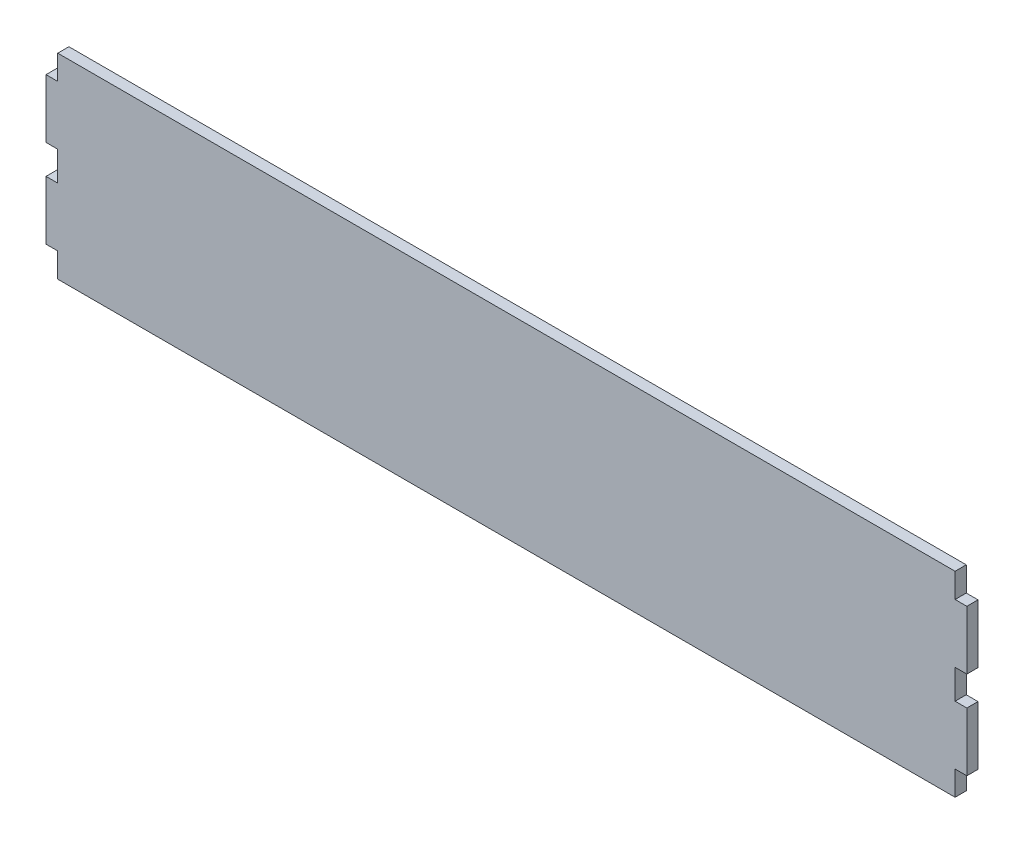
ISO-10303-21;
HEADER;
FILE_DESCRIPTION(('STEP AP214'),'2;1');
FILE_NAME('part.step','',(''),(''),'','','');
FILE_SCHEMA(('AUTOMOTIVE_DESIGN { 1 0 10303 214 1 1 1 1 }'));
ENDSEC;
DATA;
#1=APPLICATION_CONTEXT('core data for automotive mechanical design processes');
#2=APPLICATION_PROTOCOL_DEFINITION('international standard','automotive_design',2000,#1);
#3=PRODUCT_CONTEXT('',#1,'mechanical');
#4=PRODUCT('Part','Part','',(#3));
#5=PRODUCT_RELATED_PRODUCT_CATEGORY('part','',(#4));
#6=PRODUCT_DEFINITION_FORMATION('','',#4);
#7=PRODUCT_DEFINITION_CONTEXT('part definition',#1,'design');
#8=PRODUCT_DEFINITION('design','',#6,#7);
#9=PRODUCT_DEFINITION_SHAPE('','',#8);
#10=(LENGTH_UNIT() NAMED_UNIT(*) SI_UNIT(.MILLI.,.METRE.));
#11=(NAMED_UNIT(*) PLANE_ANGLE_UNIT() SI_UNIT($,.RADIAN.));
#12=(NAMED_UNIT(*) SI_UNIT($,.STERADIAN.) SOLID_ANGLE_UNIT());
#13=UNCERTAINTY_MEASURE_WITH_UNIT(LENGTH_MEASURE(1.E-05),#10,'distance_accuracy_value','');
#14=(GEOMETRIC_REPRESENTATION_CONTEXT(3) GLOBAL_UNCERTAINTY_ASSIGNED_CONTEXT((#13)) GLOBAL_UNIT_ASSIGNED_CONTEXT((#10,
#11,#12)) REPRESENTATION_CONTEXT('',''));
#15=CARTESIAN_POINT('',(0.,0.,0.));
#16=DIRECTION('',(0.,0.,1.));
#17=DIRECTION('',(1.,0.,0.));
#18=AXIS2_PLACEMENT_3D('',#15,#16,#17);
#19=CARTESIAN_POINT('',(229.2,-50.,5.7));
#20=DIRECTION('',(-1.,0.,0.));
#21=DIRECTION('',(0.,0.,1.));
#22=AXIS2_PLACEMENT_3D('',#19,#20,#21);
#23=PLANE('',#22);
#24=DIRECTION('',(0.,0.,1.));
#25=VECTOR('',#24,1.);
#26=CARTESIAN_POINT('',(229.2,-7.5,0.));
#27=LINE('',#26,#25);
#28=CARTESIAN_POINT('',(229.2,-7.5,0.));
#29=VERTEX_POINT('',#28);
#30=CARTESIAN_POINT('',(229.2,-7.5,5.7));
#31=VERTEX_POINT('',#30);
#32=EDGE_CURVE('E332',#29,#31,#27,.T.);
#33=ORIENTED_EDGE('',*,*,#32,.F.);
#34=DIRECTION('',(0.,1.,0.));
#35=VECTOR('',#34,1.);
#36=CARTESIAN_POINT('',(229.2,-50.,0.));
#37=LINE('',#36,#35);
#38=CARTESIAN_POINT('',(229.2,7.5,0.));
#39=VERTEX_POINT('',#38);
#40=EDGE_CURVE('E193',#29,#39,#37,.T.);
#41=ORIENTED_EDGE('',*,*,#40,.T.);
#42=DIRECTION('',(0.,0.,-1.));
#43=VECTOR('',#42,1.);
#44=CARTESIAN_POINT('',(229.2,7.5,0.));
#45=LINE('',#44,#43);
#46=CARTESIAN_POINT('',(229.2,7.5,5.7));
#47=VERTEX_POINT('',#46);
#48=EDGE_CURVE('E197',#47,#39,#45,.T.);
#49=ORIENTED_EDGE('',*,*,#48,.F.);
#50=DIRECTION('',(0.,1.,0.));
#51=VECTOR('',#50,1.);
#52=CARTESIAN_POINT('',(229.2,-50.,5.7));
#53=LINE('',#52,#51);
#54=EDGE_CURVE('E46',#31,#47,#53,.T.);
#55=ORIENTED_EDGE('',*,*,#54,.F.);
#56=EDGE_LOOP('',(#33,#41,#49,#55));
#57=FACE_BOUND('',#56,.T.);
#58=ADVANCED_FACE('F32',(#57),#23,.F.);
#59=DIRECTION('',(0.,0.,-1.));
#60=VECTOR('',#59,1.);
#61=CARTESIAN_POINT('',(229.2,-37.5,0.));
#62=LINE('',#61,#60);
#63=CARTESIAN_POINT('',(229.2,-37.5,5.7));
#64=VERTEX_POINT('',#63);
#65=CARTESIAN_POINT('',(229.2,-37.5,0.));
#66=VERTEX_POINT('',#65);
#67=EDGE_CURVE('E54',#64,#66,#62,.T.);
#68=ORIENTED_EDGE('',*,*,#67,.F.);
#69=CARTESIAN_POINT('',(229.2,-50.,5.7));
#70=VERTEX_POINT('',#69);
#71=EDGE_CURVE('E280',#70,#64,#53,.T.);
#72=ORIENTED_EDGE('',*,*,#71,.F.);
#73=DIRECTION('',(0.,0.,-1.));
#74=VECTOR('',#73,1.);
#75=CARTESIAN_POINT('',(229.2,-50.,5.7));
#76=LINE('',#75,#74);
#77=CARTESIAN_POINT('',(229.2,-50.,0.));
#78=VERTEX_POINT('',#77);
#79=EDGE_CURVE('E292',#70,#78,#76,.T.);
#80=ORIENTED_EDGE('',*,*,#79,.T.);
#81=EDGE_CURVE('E293',#78,#66,#37,.T.);
#82=ORIENTED_EDGE('',*,*,#81,.T.);
#83=EDGE_LOOP('',(#68,#72,#80,#82));
#84=FACE_BOUND('',#83,.T.);
#85=ADVANCED_FACE('F355',(#84),#23,.F.);
#86=DIRECTION('',(0.,0.,1.));
#87=VECTOR('',#86,1.);
#88=CARTESIAN_POINT('',(229.2,37.5,0.));
#89=LINE('',#88,#87);
#90=CARTESIAN_POINT('',(229.2,37.5,0.));
#91=VERTEX_POINT('',#90);
#92=CARTESIAN_POINT('',(229.2,37.5,5.70000000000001));
#93=VERTEX_POINT('',#92);
#94=EDGE_CURVE('E194',#91,#93,#89,.T.);
#95=ORIENTED_EDGE('',*,*,#94,.F.);
#96=CARTESIAN_POINT('',(229.2,50.,0.));
#97=VERTEX_POINT('',#96);
#98=EDGE_CURVE('E279',#91,#97,#37,.T.);
#99=ORIENTED_EDGE('',*,*,#98,.T.);
#100=DIRECTION('',(0.,0.,-1.));
#101=VECTOR('',#100,1.);
#102=CARTESIAN_POINT('',(229.2,50.,5.7));
#103=LINE('',#102,#101);
#104=CARTESIAN_POINT('',(229.2,50.,5.7));
#105=VERTEX_POINT('',#104);
#106=EDGE_CURVE('E11',#105,#97,#103,.T.);
#107=ORIENTED_EDGE('',*,*,#106,.F.);
#108=EDGE_CURVE('E283',#93,#105,#53,.T.);
#109=ORIENTED_EDGE('',*,*,#108,.F.);
#110=EDGE_LOOP('',(#95,#99,#107,#109));
#111=FACE_BOUND('',#110,.T.);
#112=ADVANCED_FACE('F330',(#111),#23,.F.);
#113=CARTESIAN_POINT('',(-229.2,-50.,5.7));
#114=DIRECTION('',(1.,0.,0.));
#115=DIRECTION('',(0.,0.,-1.));
#116=AXIS2_PLACEMENT_3D('',#113,#114,#115);
#117=PLANE('',#116);
#118=DIRECTION('',(0.,0.,1.));
#119=VECTOR('',#118,1.);
#120=CARTESIAN_POINT('',(-229.2,7.5,0.));
#121=LINE('',#120,#119);
#122=CARTESIAN_POINT('',(-229.2,7.5,0.));
#123=VERTEX_POINT('',#122);
#124=CARTESIAN_POINT('',(-229.2,7.5,5.7));
#125=VERTEX_POINT('',#124);
#126=EDGE_CURVE('E225',#123,#125,#121,.T.);
#127=ORIENTED_EDGE('',*,*,#126,.F.);
#128=DIRECTION('',(0.,-1.,0.));
#129=VECTOR('',#128,1.);
#130=CARTESIAN_POINT('',(-229.2,-50.,0.));
#131=LINE('',#130,#129);
#132=CARTESIAN_POINT('',(-229.2,-7.5,0.));
#133=VERTEX_POINT('',#132);
#134=EDGE_CURVE('E301',#123,#133,#131,.T.);
#135=ORIENTED_EDGE('',*,*,#134,.T.);
#136=DIRECTION('',(0.,0.,-1.));
#137=VECTOR('',#136,1.);
#138=CARTESIAN_POINT('',(-229.2,-7.5,0.));
#139=LINE('',#138,#137);
#140=CARTESIAN_POINT('',(-229.2,-7.5,5.7));
#141=VERTEX_POINT('',#140);
#142=EDGE_CURVE('E257',#141,#133,#139,.T.);
#143=ORIENTED_EDGE('',*,*,#142,.F.);
#144=DIRECTION('',(0.,-1.,0.));
#145=VECTOR('',#144,1.);
#146=CARTESIAN_POINT('',(-229.2,-50.,5.7));
#147=LINE('',#146,#145);
#148=EDGE_CURVE('E290',#125,#141,#147,.T.);
#149=ORIENTED_EDGE('',*,*,#148,.F.);
#150=EDGE_LOOP('',(#127,#135,#143,#149));
#151=FACE_BOUND('',#150,.T.);
#152=ADVANCED_FACE('F367',(#151),#117,.F.);
#153=DIRECTION('',(0.,0.,-1.));
#154=VECTOR('',#153,1.);
#155=CARTESIAN_POINT('',(-229.2,37.5,0.));
#156=LINE('',#155,#154);
#157=CARTESIAN_POINT('',(-229.2,37.5,5.7));
#158=VERTEX_POINT('',#157);
#159=CARTESIAN_POINT('',(-229.2,37.5,0.));
#160=VERTEX_POINT('',#159);
#161=EDGE_CURVE('E230',#158,#160,#156,.T.);
#162=ORIENTED_EDGE('',*,*,#161,.F.);
#163=CARTESIAN_POINT('',(-229.2,50.,5.7));
#164=VERTEX_POINT('',#163);
#165=EDGE_CURVE('E286',#164,#158,#147,.T.);
#166=ORIENTED_EDGE('',*,*,#165,.F.);
#167=DIRECTION('',(0.,0.,-1.));
#168=VECTOR('',#167,1.);
#169=CARTESIAN_POINT('',(-229.2,50.,5.7));
#170=LINE('',#169,#168);
#171=CARTESIAN_POINT('',(-229.2,50.,0.));
#172=VERTEX_POINT('',#171);
#173=EDGE_CURVE('E39',#164,#172,#170,.T.);
#174=ORIENTED_EDGE('',*,*,#173,.T.);
#175=EDGE_CURVE('E298',#172,#160,#131,.T.);
#176=ORIENTED_EDGE('',*,*,#175,.T.);
#177=EDGE_LOOP('',(#162,#166,#174,#176));
#178=FACE_BOUND('',#177,.T.);
#179=ADVANCED_FACE('F312',(#178),#117,.F.);
#180=DIRECTION('',(0.,0.,1.));
#181=VECTOR('',#180,1.);
#182=CARTESIAN_POINT('',(-229.2,-37.5,0.));
#183=LINE('',#182,#181);
#184=CARTESIAN_POINT('',(-229.2,-37.5,0.));
#185=VERTEX_POINT('',#184);
#186=CARTESIAN_POINT('',(-229.2,-37.5,5.7));
#187=VERTEX_POINT('',#186);
#188=EDGE_CURVE('E252',#185,#187,#183,.T.);
#189=ORIENTED_EDGE('',*,*,#188,.F.);
#190=CARTESIAN_POINT('',(-229.2,-50.,0.));
#191=VERTEX_POINT('',#190);
#192=EDGE_CURVE('E297',#185,#191,#131,.T.);
#193=ORIENTED_EDGE('',*,*,#192,.T.);
#194=DIRECTION('',(0.,0.,-1.));
#195=VECTOR('',#194,1.);
#196=CARTESIAN_POINT('',(-229.2,-50.,5.7));
#197=LINE('',#196,#195);
#198=CARTESIAN_POINT('',(-229.2,-50.,5.7));
#199=VERTEX_POINT('',#198);
#200=EDGE_CURVE('E305',#199,#191,#197,.T.);
#201=ORIENTED_EDGE('',*,*,#200,.F.);
#202=EDGE_CURVE('E285',#187,#199,#147,.T.);
#203=ORIENTED_EDGE('',*,*,#202,.F.);
#204=EDGE_LOOP('',(#189,#193,#201,#203));
#205=FACE_BOUND('',#204,.T.);
#206=ADVANCED_FACE('F362',(#205),#117,.F.);
#207=CARTESIAN_POINT('',(-229.2,50.,5.7));
#208=DIRECTION('',(0.,-1.,0.));
#209=DIRECTION('',(0.,0.,-1.));
#210=AXIS2_PLACEMENT_3D('',#207,#208,#209);
#211=PLANE('',#210);
#212=DIRECTION('',(-1.,0.,0.));
#213=VECTOR('',#212,1.);
#214=CARTESIAN_POINT('',(-229.2,50.,0.));
#215=LINE('',#214,#213);
#216=EDGE_CURVE('E295',#97,#172,#215,.T.);
#217=ORIENTED_EDGE('',*,*,#216,.T.);
#218=ORIENTED_EDGE('',*,*,#173,.F.);
#219=DIRECTION('',(-1.,0.,0.));
#220=VECTOR('',#219,1.);
#221=CARTESIAN_POINT('',(-229.2,50.,5.7));
#222=LINE('',#221,#220);
#223=EDGE_CURVE('E282',#105,#164,#222,.T.);
#224=ORIENTED_EDGE('',*,*,#223,.F.);
#225=ORIENTED_EDGE('',*,*,#106,.T.);
#226=EDGE_LOOP('',(#217,#218,#224,#225));
#227=FACE_BOUND('',#226,.T.);
#228=ADVANCED_FACE('F328',(#227),#211,.F.);
#229=CARTESIAN_POINT('',(-229.2,-50.,5.7));
#230=DIRECTION('',(0.,1.,0.));
#231=DIRECTION('',(0.,0.,1.));
#232=AXIS2_PLACEMENT_3D('',#229,#230,#231);
#233=PLANE('',#232);
#234=DIRECTION('',(1.,0.,0.));
#235=VECTOR('',#234,1.);
#236=CARTESIAN_POINT('',(-229.2,-50.,0.));
#237=LINE('',#236,#235);
#238=EDGE_CURVE('E300',#191,#78,#237,.T.);
#239=ORIENTED_EDGE('',*,*,#238,.T.);
#240=ORIENTED_EDGE('',*,*,#79,.F.);
#241=DIRECTION('',(1.,0.,0.));
#242=VECTOR('',#241,1.);
#243=CARTESIAN_POINT('',(-229.2,-50.,5.7));
#244=LINE('',#243,#242);
#245=EDGE_CURVE('E289',#199,#70,#244,.T.);
#246=ORIENTED_EDGE('',*,*,#245,.F.);
#247=ORIENTED_EDGE('',*,*,#200,.T.);
#248=EDGE_LOOP('',(#239,#240,#246,#247));
#249=FACE_BOUND('',#248,.T.);
#250=ADVANCED_FACE('F359',(#249),#233,.F.);
#251=CARTESIAN_POINT('',(0.,0.,5.7));
#252=DIRECTION('',(0.,0.,-1.));
#253=DIRECTION('',(-1.,0.,0.));
#254=AXIS2_PLACEMENT_3D('',#251,#252,#253);
#255=PLANE('',#254);
#256=ORIENTED_EDGE('',*,*,#71,.T.);
#257=DIRECTION('',(-1.,0.,0.));
#258=VECTOR('',#257,1.);
#259=CARTESIAN_POINT('',(235.2,-37.5,5.7));
#260=LINE('',#259,#258);
#261=CARTESIAN_POINT('',(235.2,-37.5,5.7));
#262=VERTEX_POINT('',#261);
#263=EDGE_CURVE('E199',#262,#64,#260,.T.);
#264=ORIENTED_EDGE('',*,*,#263,.F.);
#265=DIRECTION('',(0.,-1.,0.));
#266=VECTOR('',#265,1.);
#267=CARTESIAN_POINT('',(235.2,-7.5,5.70000000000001));
#268=LINE('',#267,#266);
#269=CARTESIAN_POINT('',(235.2,-7.5,5.70000000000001));
#270=VERTEX_POINT('',#269);
#271=EDGE_CURVE('E179',#270,#262,#268,.T.);
#272=ORIENTED_EDGE('',*,*,#271,.F.);
#273=DIRECTION('',(-1.,0.,0.));
#274=VECTOR('',#273,1.);
#275=CARTESIAN_POINT('',(235.2,-7.5,5.70000000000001));
#276=LINE('',#275,#274);
#277=EDGE_CURVE('E176',#270,#31,#276,.T.);
#278=ORIENTED_EDGE('',*,*,#277,.T.);
#279=ORIENTED_EDGE('',*,*,#54,.T.);
#280=DIRECTION('',(-1.,0.,0.));
#281=VECTOR('',#280,1.);
#282=CARTESIAN_POINT('',(235.2,7.5,5.70000000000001));
#283=LINE('',#282,#281);
#284=CARTESIAN_POINT('',(235.2,7.5,5.70000000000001));
#285=VERTEX_POINT('',#284);
#286=EDGE_CURVE('E216',#285,#47,#283,.T.);
#287=ORIENTED_EDGE('',*,*,#286,.F.);
#288=DIRECTION('',(0.,-1.,0.));
#289=VECTOR('',#288,1.);
#290=CARTESIAN_POINT('',(235.2,37.5,5.70000000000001));
#291=LINE('',#290,#289);
#292=CARTESIAN_POINT('',(235.2,37.5,5.70000000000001));
#293=VERTEX_POINT('',#292);
#294=EDGE_CURVE('E208',#293,#285,#291,.T.);
#295=ORIENTED_EDGE('',*,*,#294,.F.);
#296=DIRECTION('',(-1.,0.,0.));
#297=VECTOR('',#296,1.);
#298=CARTESIAN_POINT('',(235.2,37.5,5.70000000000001));
#299=LINE('',#298,#297);
#300=EDGE_CURVE('E219',#293,#93,#299,.T.);
#301=ORIENTED_EDGE('',*,*,#300,.T.);
#302=ORIENTED_EDGE('',*,*,#108,.T.);
#303=ORIENTED_EDGE('',*,*,#223,.T.);
#304=ORIENTED_EDGE('',*,*,#165,.T.);
#305=DIRECTION('',(1.,0.,0.));
#306=VECTOR('',#305,1.);
#307=CARTESIAN_POINT('',(-235.2,37.5,5.7));
#308=LINE('',#307,#306);
#309=CARTESIAN_POINT('',(-235.2,37.5,5.7));
#310=VERTEX_POINT('',#309);
#311=EDGE_CURVE('E243',#310,#158,#308,.T.);
#312=ORIENTED_EDGE('',*,*,#311,.F.);
#313=DIRECTION('',(0.,1.,0.));
#314=VECTOR('',#313,1.);
#315=CARTESIAN_POINT('',(-235.2,7.5,5.7));
#316=LINE('',#315,#314);
#317=CARTESIAN_POINT('',(-235.2,7.5,5.7));
#318=VERTEX_POINT('',#317);
#319=EDGE_CURVE('E232',#318,#310,#316,.T.);
#320=ORIENTED_EDGE('',*,*,#319,.F.);
#321=DIRECTION('',(1.,0.,0.));
#322=VECTOR('',#321,1.);
#323=CARTESIAN_POINT('',(-235.2,7.5,5.7));
#324=LINE('',#323,#322);
#325=EDGE_CURVE('E246',#318,#125,#324,.T.);
#326=ORIENTED_EDGE('',*,*,#325,.T.);
#327=ORIENTED_EDGE('',*,*,#148,.T.);
#328=DIRECTION('',(1.,0.,0.));
#329=VECTOR('',#328,1.);
#330=CARTESIAN_POINT('',(-235.2,-7.5,5.7));
#331=LINE('',#330,#329);
#332=CARTESIAN_POINT('',(-235.2,-7.5,5.7));
#333=VERTEX_POINT('',#332);
#334=EDGE_CURVE('E270',#333,#141,#331,.T.);
#335=ORIENTED_EDGE('',*,*,#334,.F.);
#336=DIRECTION('',(0.,1.,0.));
#337=VECTOR('',#336,1.);
#338=CARTESIAN_POINT('',(-235.2,-37.5,5.7));
#339=LINE('',#338,#337);
#340=CARTESIAN_POINT('',(-235.2,-37.5,5.7));
#341=VERTEX_POINT('',#340);
#342=EDGE_CURVE('E259',#341,#333,#339,.T.);
#343=ORIENTED_EDGE('',*,*,#342,.F.);
#344=DIRECTION('',(1.,0.,0.));
#345=VECTOR('',#344,1.);
#346=CARTESIAN_POINT('',(-235.2,-37.5,5.7));
#347=LINE('',#346,#345);
#348=EDGE_CURVE('E273',#341,#187,#347,.T.);
#349=ORIENTED_EDGE('',*,*,#348,.T.);
#350=ORIENTED_EDGE('',*,*,#202,.T.);
#351=ORIENTED_EDGE('',*,*,#245,.T.);
#352=EDGE_LOOP('',(#256,#264,#272,#278,#279,#287,#295,#301,#302,#303,#304,#312,#320,#326,#327,
#335,#343,#349,#350,#351));
#353=FACE_BOUND('',#352,.T.);
#354=ADVANCED_FACE('F325',(#353),#255,.F.);
#355=CARTESIAN_POINT('',(0.,0.,0.));
#356=DIRECTION('',(0.,0.,-1.));
#357=DIRECTION('',(-1.,0.,0.));
#358=AXIS2_PLACEMENT_3D('',#355,#356,#357);
#359=PLANE('',#358);
#360=ORIENTED_EDGE('',*,*,#81,.F.);
#361=ORIENTED_EDGE('',*,*,#238,.F.);
#362=ORIENTED_EDGE('',*,*,#192,.F.);
#363=DIRECTION('',(1.,0.,0.));
#364=VECTOR('',#363,1.);
#365=CARTESIAN_POINT('',(-235.2,-37.5,0.));
#366=LINE('',#365,#364);
#367=CARTESIAN_POINT('',(-235.2,-37.5,0.));
#368=VERTEX_POINT('',#367);
#369=EDGE_CURVE('E276',#368,#185,#366,.T.);
#370=ORIENTED_EDGE('',*,*,#369,.F.);
#371=DIRECTION('',(0.,-1.,0.));
#372=VECTOR('',#371,1.);
#373=CARTESIAN_POINT('',(-235.2,-37.5,0.));
#374=LINE('',#373,#372);
#375=CARTESIAN_POINT('',(-235.2,-7.5,0.));
#376=VERTEX_POINT('',#375);
#377=EDGE_CURVE('E253',#376,#368,#374,.T.);
#378=ORIENTED_EDGE('',*,*,#377,.F.);
#379=DIRECTION('',(1.,0.,0.));
#380=VECTOR('',#379,1.);
#381=CARTESIAN_POINT('',(-235.2,-7.5,0.));
#382=LINE('',#381,#380);
#383=EDGE_CURVE('E263',#376,#133,#382,.T.);
#384=ORIENTED_EDGE('',*,*,#383,.T.);
#385=ORIENTED_EDGE('',*,*,#134,.F.);
#386=DIRECTION('',(1.,0.,0.));
#387=VECTOR('',#386,1.);
#388=CARTESIAN_POINT('',(-235.2,7.5,0.));
#389=LINE('',#388,#387);
#390=CARTESIAN_POINT('',(-235.2,7.5,0.));
#391=VERTEX_POINT('',#390);
#392=EDGE_CURVE('E249',#391,#123,#389,.T.);
#393=ORIENTED_EDGE('',*,*,#392,.F.);
#394=DIRECTION('',(0.,-1.,0.));
#395=VECTOR('',#394,1.);
#396=CARTESIAN_POINT('',(-235.2,7.5,0.));
#397=LINE('',#396,#395);
#398=CARTESIAN_POINT('',(-235.2,37.5,0.));
#399=VERTEX_POINT('',#398);
#400=EDGE_CURVE('E226',#399,#391,#397,.T.);
#401=ORIENTED_EDGE('',*,*,#400,.F.);
#402=DIRECTION('',(1.,0.,0.));
#403=VECTOR('',#402,1.);
#404=CARTESIAN_POINT('',(-235.2,37.5,0.));
#405=LINE('',#404,#403);
#406=EDGE_CURVE('E236',#399,#160,#405,.T.);
#407=ORIENTED_EDGE('',*,*,#406,.T.);
#408=ORIENTED_EDGE('',*,*,#175,.F.);
#409=ORIENTED_EDGE('',*,*,#216,.F.);
#410=ORIENTED_EDGE('',*,*,#98,.F.);
#411=DIRECTION('',(-1.,0.,0.));
#412=VECTOR('',#411,1.);
#413=CARTESIAN_POINT('',(235.2,37.5,0.));
#414=LINE('',#413,#412);
#415=CARTESIAN_POINT('',(235.2,37.5,0.));
#416=VERTEX_POINT('',#415);
#417=EDGE_CURVE('E222',#416,#91,#414,.T.);
#418=ORIENTED_EDGE('',*,*,#417,.F.);
#419=DIRECTION('',(0.,1.,0.));
#420=VECTOR('',#419,1.);
#421=CARTESIAN_POINT('',(235.2,37.5,0.));
#422=LINE('',#421,#420);
#423=CARTESIAN_POINT('',(235.2,7.5,0.));
#424=VERTEX_POINT('',#423);
#425=EDGE_CURVE('E203',#424,#416,#422,.T.);
#426=ORIENTED_EDGE('',*,*,#425,.F.);
#427=DIRECTION('',(-1.,0.,0.));
#428=VECTOR('',#427,1.);
#429=CARTESIAN_POINT('',(235.2,7.5,0.));
#430=LINE('',#429,#428);
#431=EDGE_CURVE('E211',#424,#39,#430,.T.);
#432=ORIENTED_EDGE('',*,*,#431,.T.);
#433=ORIENTED_EDGE('',*,*,#40,.F.);
#434=DIRECTION('',(-1.,0.,0.));
#435=VECTOR('',#434,1.);
#436=CARTESIAN_POINT('',(235.2,-7.5,0.));
#437=LINE('',#436,#435);
#438=CARTESIAN_POINT('',(235.2,-7.5,0.));
#439=VERTEX_POINT('',#438);
#440=EDGE_CURVE('E174',#439,#29,#437,.T.);
#441=ORIENTED_EDGE('',*,*,#440,.F.);
#442=DIRECTION('',(0.,1.,0.));
#443=VECTOR('',#442,1.);
#444=CARTESIAN_POINT('',(235.2,-7.5,0.));
#445=LINE('',#444,#443);
#446=CARTESIAN_POINT('',(235.2,-37.5,0.));
#447=VERTEX_POINT('',#446);
#448=EDGE_CURVE('E180',#447,#439,#445,.T.);
#449=ORIENTED_EDGE('',*,*,#448,.F.);
#450=DIRECTION('',(-1.,0.,0.));
#451=VECTOR('',#450,1.);
#452=CARTESIAN_POINT('',(235.2,-37.5,0.));
#453=LINE('',#452,#451);
#454=EDGE_CURVE('E346',#447,#66,#453,.T.);
#455=ORIENTED_EDGE('',*,*,#454,.T.);
#456=EDGE_LOOP('',(#360,#361,#362,#370,#378,#384,#385,#393,#401,#407,#408,#409,#410,#418,#426,
#432,#433,#441,#449,#455));
#457=FACE_BOUND('',#456,.T.);
#458=ADVANCED_FACE('F191',(#457),#359,.T.);
#459=CARTESIAN_POINT('',(-235.2,-37.5,0.));
#460=DIRECTION('',(0.,1.,0.));
#461=DIRECTION('',(0.,0.,1.));
#462=AXIS2_PLACEMENT_3D('',#459,#460,#461);
#463=PLANE('',#462);
#464=ORIENTED_EDGE('',*,*,#188,.T.);
#465=ORIENTED_EDGE('',*,*,#348,.F.);
#466=DIRECTION('',(0.,0.,1.));
#467=VECTOR('',#466,1.);
#468=CARTESIAN_POINT('',(-235.2,-37.5,0.));
#469=LINE('',#468,#467);
#470=EDGE_CURVE('E256',#368,#341,#469,.T.);
#471=ORIENTED_EDGE('',*,*,#470,.F.);
#472=ORIENTED_EDGE('',*,*,#369,.T.);
#473=EDGE_LOOP('',(#464,#465,#471,#472));
#474=FACE_BOUND('',#473,.T.);
#475=ADVANCED_FACE('F380',(#474),#463,.F.);
#476=CARTESIAN_POINT('',(-235.2,-7.5,0.));
#477=DIRECTION('',(0.,-1.,0.));
#478=DIRECTION('',(0.,0.,-1.));
#479=AXIS2_PLACEMENT_3D('',#476,#477,#478);
#480=PLANE('',#479);
#481=ORIENTED_EDGE('',*,*,#142,.T.);
#482=ORIENTED_EDGE('',*,*,#383,.F.);
#483=DIRECTION('',(0.,0.,-1.));
#484=VECTOR('',#483,1.);
#485=CARTESIAN_POINT('',(-235.2,-7.5,0.));
#486=LINE('',#485,#484);
#487=EDGE_CURVE('E261',#333,#376,#486,.T.);
#488=ORIENTED_EDGE('',*,*,#487,.F.);
#489=ORIENTED_EDGE('',*,*,#334,.T.);
#490=EDGE_LOOP('',(#481,#482,#488,#489));
#491=FACE_BOUND('',#490,.T.);
#492=ADVANCED_FACE('F370',(#491),#480,.F.);
#493=CARTESIAN_POINT('',(-235.2,0.,0.));
#494=DIRECTION('',(1.,0.,0.));
#495=DIRECTION('',(0.,0.,-1.));
#496=AXIS2_PLACEMENT_3D('',#493,#494,#495);
#497=PLANE('',#496);
#498=ORIENTED_EDGE('',*,*,#377,.T.);
#499=ORIENTED_EDGE('',*,*,#470,.T.);
#500=ORIENTED_EDGE('',*,*,#342,.T.);
#501=ORIENTED_EDGE('',*,*,#487,.T.);
#502=EDGE_LOOP('',(#498,#499,#500,#501));
#503=FACE_BOUND('',#502,.T.);
#504=ADVANCED_FACE('F375',(#503),#497,.F.);
#505=CARTESIAN_POINT('',(-235.2,7.5,0.));
#506=DIRECTION('',(0.,1.,0.));
#507=DIRECTION('',(0.,0.,1.));
#508=AXIS2_PLACEMENT_3D('',#505,#506,#507);
#509=PLANE('',#508);
#510=ORIENTED_EDGE('',*,*,#126,.T.);
#511=ORIENTED_EDGE('',*,*,#325,.F.);
#512=DIRECTION('',(0.,0.,1.));
#513=VECTOR('',#512,1.);
#514=CARTESIAN_POINT('',(-235.2,7.5,0.));
#515=LINE('',#514,#513);
#516=EDGE_CURVE('E229',#391,#318,#515,.T.);
#517=ORIENTED_EDGE('',*,*,#516,.F.);
#518=ORIENTED_EDGE('',*,*,#392,.T.);
#519=EDGE_LOOP('',(#510,#511,#517,#518));
#520=FACE_BOUND('',#519,.T.);
#521=ADVANCED_FACE('F481',(#520),#509,.F.);
#522=CARTESIAN_POINT('',(-235.2,37.5,0.));
#523=DIRECTION('',(0.,-1.,0.));
#524=DIRECTION('',(0.,0.,-1.));
#525=AXIS2_PLACEMENT_3D('',#522,#523,#524);
#526=PLANE('',#525);
#527=ORIENTED_EDGE('',*,*,#161,.T.);
#528=ORIENTED_EDGE('',*,*,#406,.F.);
#529=DIRECTION('',(0.,0.,-1.));
#530=VECTOR('',#529,1.);
#531=CARTESIAN_POINT('',(-235.2,37.5,0.));
#532=LINE('',#531,#530);
#533=EDGE_CURVE('E234',#310,#399,#532,.T.);
#534=ORIENTED_EDGE('',*,*,#533,.F.);
#535=ORIENTED_EDGE('',*,*,#311,.T.);
#536=EDGE_LOOP('',(#527,#528,#534,#535));
#537=FACE_BOUND('',#536,.T.);
#538=ADVANCED_FACE('F322',(#537),#526,.F.);
#539=CARTESIAN_POINT('',(-235.2,0.,0.));
#540=DIRECTION('',(1.,0.,0.));
#541=DIRECTION('',(0.,0.,-1.));
#542=AXIS2_PLACEMENT_3D('',#539,#540,#541);
#543=PLANE('',#542);
#544=ORIENTED_EDGE('',*,*,#400,.T.);
#545=ORIENTED_EDGE('',*,*,#516,.T.);
#546=ORIENTED_EDGE('',*,*,#319,.T.);
#547=ORIENTED_EDGE('',*,*,#533,.T.);
#548=EDGE_LOOP('',(#544,#545,#546,#547));
#549=FACE_BOUND('',#548,.T.);
#550=ADVANCED_FACE('F430',(#549),#543,.F.);
#551=CARTESIAN_POINT('',(235.2,37.5,0.));
#552=DIRECTION('',(0.,-1.,0.));
#553=DIRECTION('',(0.,0.,-1.));
#554=AXIS2_PLACEMENT_3D('',#551,#552,#553);
#555=PLANE('',#554);
#556=ORIENTED_EDGE('',*,*,#94,.T.);
#557=ORIENTED_EDGE('',*,*,#300,.F.);
#558=DIRECTION('',(0.,0.,1.));
#559=VECTOR('',#558,1.);
#560=CARTESIAN_POINT('',(235.2,37.5,0.));
#561=LINE('',#560,#559);
#562=EDGE_CURVE('E206',#416,#293,#561,.T.);
#563=ORIENTED_EDGE('',*,*,#562,.F.);
#564=ORIENTED_EDGE('',*,*,#417,.T.);
#565=EDGE_LOOP('',(#556,#557,#563,#564));
#566=FACE_BOUND('',#565,.T.);
#567=ADVANCED_FACE('F426',(#566),#555,.F.);
#568=CARTESIAN_POINT('',(235.2,7.5,0.));
#569=DIRECTION('',(0.,1.,0.));
#570=DIRECTION('',(0.,0.,1.));
#571=AXIS2_PLACEMENT_3D('',#568,#569,#570);
#572=PLANE('',#571);
#573=ORIENTED_EDGE('',*,*,#48,.T.);
#574=ORIENTED_EDGE('',*,*,#431,.F.);
#575=DIRECTION('',(0.,0.,-1.));
#576=VECTOR('',#575,1.);
#577=CARTESIAN_POINT('',(235.2,7.5,0.));
#578=LINE('',#577,#576);
#579=EDGE_CURVE('E210',#285,#424,#578,.T.);
#580=ORIENTED_EDGE('',*,*,#579,.F.);
#581=ORIENTED_EDGE('',*,*,#286,.T.);
#582=EDGE_LOOP('',(#573,#574,#580,#581));
#583=FACE_BOUND('',#582,.T.);
#584=ADVANCED_FACE('F335',(#583),#572,.F.);
#585=CARTESIAN_POINT('',(235.2,0.,0.));
#586=DIRECTION('',(-1.,0.,0.));
#587=DIRECTION('',(0.,0.,1.));
#588=AXIS2_PLACEMENT_3D('',#585,#586,#587);
#589=PLANE('',#588);
#590=ORIENTED_EDGE('',*,*,#425,.T.);
#591=ORIENTED_EDGE('',*,*,#562,.T.);
#592=ORIENTED_EDGE('',*,*,#294,.T.);
#593=ORIENTED_EDGE('',*,*,#579,.T.);
#594=EDGE_LOOP('',(#590,#591,#592,#593));
#595=FACE_BOUND('',#594,.T.);
#596=ADVANCED_FACE('F340',(#595),#589,.F.);
#597=CARTESIAN_POINT('',(235.2,-7.5,0.));
#598=DIRECTION('',(0.,-1.,0.));
#599=DIRECTION('',(0.,0.,-1.));
#600=AXIS2_PLACEMENT_3D('',#597,#598,#599);
#601=PLANE('',#600);
#602=ORIENTED_EDGE('',*,*,#32,.T.);
#603=ORIENTED_EDGE('',*,*,#277,.F.);
#604=DIRECTION('',(0.,0.,1.));
#605=VECTOR('',#604,1.);
#606=CARTESIAN_POINT('',(235.2,-7.5,0.));
#607=LINE('',#606,#605);
#608=EDGE_CURVE('E170',#439,#270,#607,.T.);
#609=ORIENTED_EDGE('',*,*,#608,.F.);
#610=ORIENTED_EDGE('',*,*,#440,.T.);
#611=EDGE_LOOP('',(#602,#603,#609,#610));
#612=FACE_BOUND('',#611,.T.);
#613=ADVANCED_FACE('F172',(#612),#601,.F.);
#614=CARTESIAN_POINT('',(235.2,-37.5,0.));
#615=DIRECTION('',(0.,1.,0.));
#616=DIRECTION('',(0.,0.,1.));
#617=AXIS2_PLACEMENT_3D('',#614,#615,#616);
#618=PLANE('',#617);
#619=ORIENTED_EDGE('',*,*,#67,.T.);
#620=ORIENTED_EDGE('',*,*,#454,.F.);
#621=DIRECTION('',(0.,0.,-1.));
#622=VECTOR('',#621,1.);
#623=CARTESIAN_POINT('',(235.2,-37.5,0.));
#624=LINE('',#623,#622);
#625=EDGE_CURVE('E185',#262,#447,#624,.T.);
#626=ORIENTED_EDGE('',*,*,#625,.F.);
#627=ORIENTED_EDGE('',*,*,#263,.T.);
#628=EDGE_LOOP('',(#619,#620,#626,#627));
#629=FACE_BOUND('',#628,.T.);
#630=ADVANCED_FACE('F352',(#629),#618,.F.);
#631=CARTESIAN_POINT('',(235.2,0.,0.));
#632=DIRECTION('',(-1.,0.,0.));
#633=DIRECTION('',(0.,0.,1.));
#634=AXIS2_PLACEMENT_3D('',#631,#632,#633);
#635=PLANE('',#634);
#636=ORIENTED_EDGE('',*,*,#448,.T.);
#637=ORIENTED_EDGE('',*,*,#608,.T.);
#638=ORIENTED_EDGE('',*,*,#271,.T.);
#639=ORIENTED_EDGE('',*,*,#625,.T.);
#640=EDGE_LOOP('',(#636,#637,#638,#639));
#641=FACE_BOUND('',#640,.T.);
#642=ADVANCED_FACE('F183',(#641),#635,.F.);
#643=CLOSED_SHELL('',(#58,#85,#112,#152,#179,#206,#228,#250,#354,#458,#475,#492,#504,#521,#538,
#550,#567,#584,#596,#613,#630,#642));
#644=MANIFOLD_SOLID_BREP('B2',#643);
#645=ADVANCED_BREP_SHAPE_REPRESENTATION('',(#18,#644),#14);
#646=SHAPE_DEFINITION_REPRESENTATION(#9,#645);
ENDSEC;
END-ISO-10303-21;
